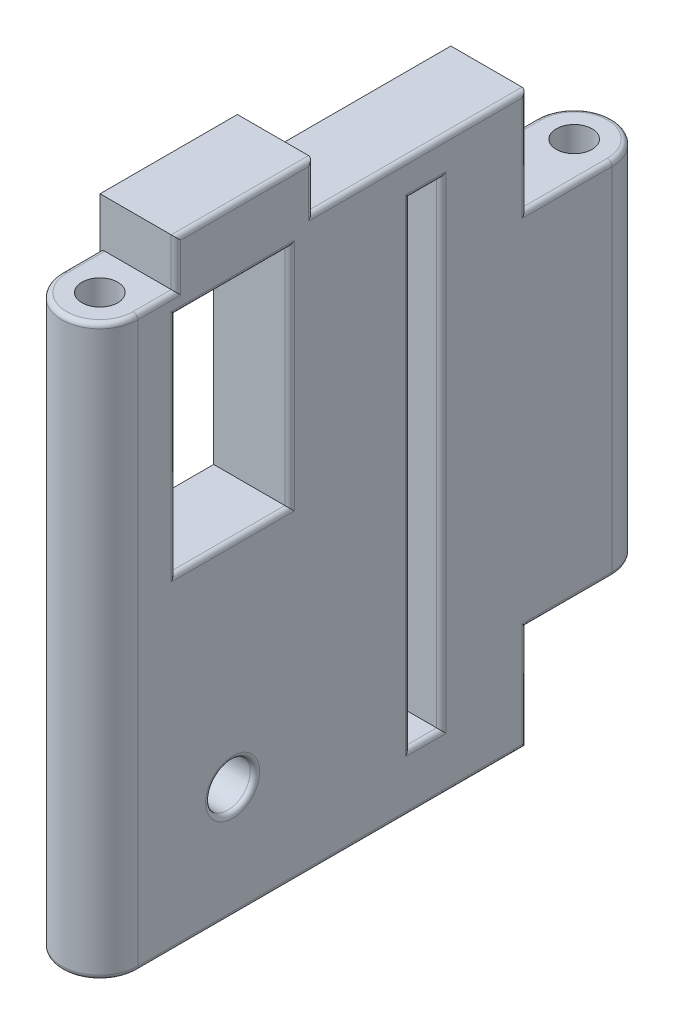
from build123d import *

# Parameters (mm, degrees)
BODY_DEPTH            = 60
SKETCH2_R             = 2.35
SKETCH2_W             = 22.125890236
SKETCH2_H             = 11
SKETCH2_W_2           = 12
SKETCH2_H_2           = 23.7
SERVOSLOT_DEPTH       = 50
SKETCH3_R             = 1.8875
HOLEBACK_DEPTH        = 81.820789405
SKETCH5_W             = 8
SKETCH5_H             = 14.475505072
SERVOMOUNTEXTRA_DEPTH = 5
SKETCH7_W             = 3.3
SKETCH7_H             = 50.3
GEARSUPPORTSLOT_DEPTH = 10
FILLET5_R             = 0.5


with BuildPart() as part:
    # Sketch1 → body (new body)
    with BuildSketch(Plane(origin=(0, 0, 0), x_dir=(1, 0, 0), z_dir=(0, 1, 0))):
        with BuildLine():
            Line((4, 0), (4, -50))
            ThreePointArc((4, -50), (0, -54), (-4, -50))
            Line((-4, -50), (-4, 0))
            ThreePointArc((-4, 0), (0, 4), (4, 0))
        make_face()
    extrude(amount=BODY_DEPTH)

    # Sketch2 → servoslot (cut)
    with BuildSketch(Plane.ZY.offset(4)):
        with Locations((40, 11.8464)):
            Circle(SKETCH2_R)
        with Locations((-2.062945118, 54.5)):
            Rectangle(SKETCH2_W, SKETCH2_H)
        with Locations((-2.062945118, 5.5)):
            Rectangle(SKETCH2_W, SKETCH2_H)
        with Locations((40, 46.15)):
            Rectangle(SKETCH2_W_2, SKETCH2_H_2)
    extrude(amount=-SERVOSLOT_DEPTH, mode=Mode.SUBTRACT)

    # Sketch3 → holeback (cut, through all)
    with BuildSketch(Plane.XZ):
        with Locations(Location((0, 50, 0), (0, 0, 270))):
            Circle(SKETCH3_R)
        with Locations(Location((0, 0, 0), (0, 0, 270))):
            Circle(SKETCH3_R)
    extrude(amount=-HOLEBACK_DEPTH, mode=Mode.SUBTRACT)

    # Sketch5 → servomountextra (add)
    with BuildSketch(Plane(origin=(0, 60, 0), x_dir=(1, 0, 0), z_dir=(0, 1, 0))):
        with Locations((0, -38.737752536)):
            Rectangle(SKETCH5_W, SKETCH5_H)
    extrude(amount=SERVOMOUNTEXTRA_DEPTH)

    # Sketch7 → gearsupportslot (cut)
    with BuildSketch(Plane.ZY.offset(4)):
        with Locations((19.65, 31.15)):
            Rectangle(SKETCH7_W, SKETCH7_H)
    extrude(amount=-GEARSUPPORTSLOT_DEPTH, mode=Mode.SUBTRACT)

    # Fillet5
    fillet5_edges = [part.edges().sort_by_distance(p)[0] for p in [
        (4, 31.15, 21.3),
        (4, 6, 19.65),
        (4, 31.15, 18),
        (4, 56.3, 19.65),
        (4, 46.15, 46),
        (4, 34.3, 40),
        (4, 46.15, 34),
        (4, 58, 40),
        (-4, 60, 47.987752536),
        (0, 60, 54),
        (-4, 49, 4.5),
        (0, 49, -4),
        (-4, 11, 4.5),
        (0, 11, -4),
        (-4, 0, 29.5),
        (0, 0, 54),
        (4, 60, 47.987752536),
        (4, 62.5, 45.975505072),
        (4, 65, 38.737752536),
        (4, 62.5, 31.5),
        (4, 60, 20.25),
        (4, 54.5, 9),
        (4, 49, 4.5),
        (4, 11, 4.5),
        (4, 5.5, 9),
        (4, 0, 29.5),
        (4, 11.8464, 37.65),
    ]]
    fillet(fillet5_edges, radius=FILLET5_R)


solid = part.part
